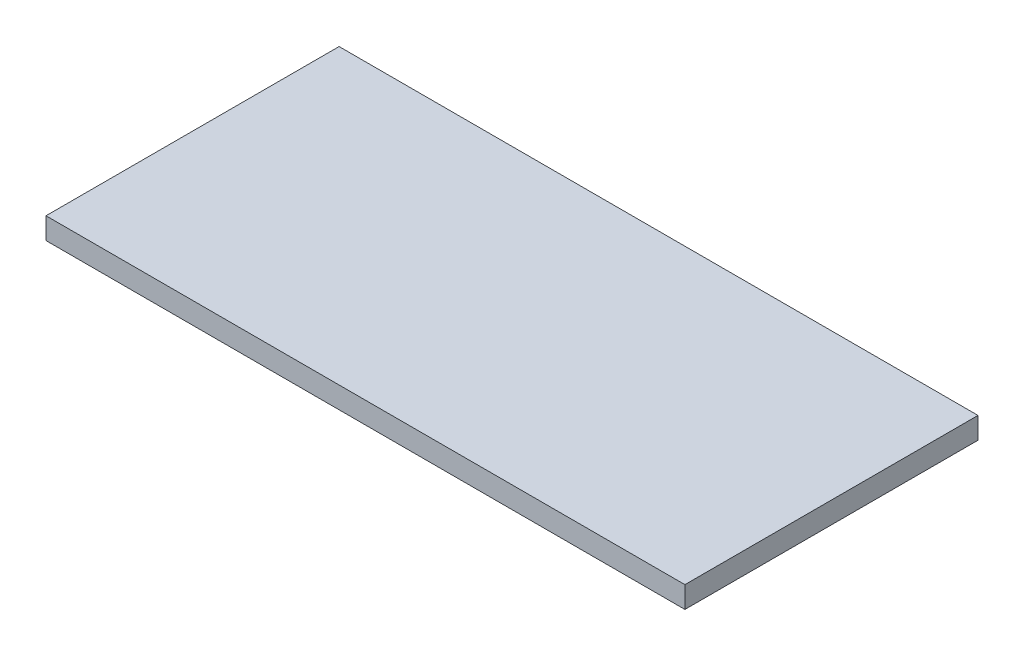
from build123d import *

# Parameters (mm, degrees)
ESQUISSE1_W        = 303
ESQUISSE1_H        = 139
BOSS_EXTRU_1_DEPTH = 5.1


with BuildPart() as part:
    # Esquisse1 → Boss.-Extru.1 (new, symmetric)
    with BuildSketch(Plane(origin=(0, 0, 0), x_dir=(1, 0, 0), z_dir=(0, 1, 0))):
        Rectangle(ESQUISSE1_W, ESQUISSE1_H)
    extrude(amount=BOSS_EXTRU_1_DEPTH, both=True)


solid = part.part
